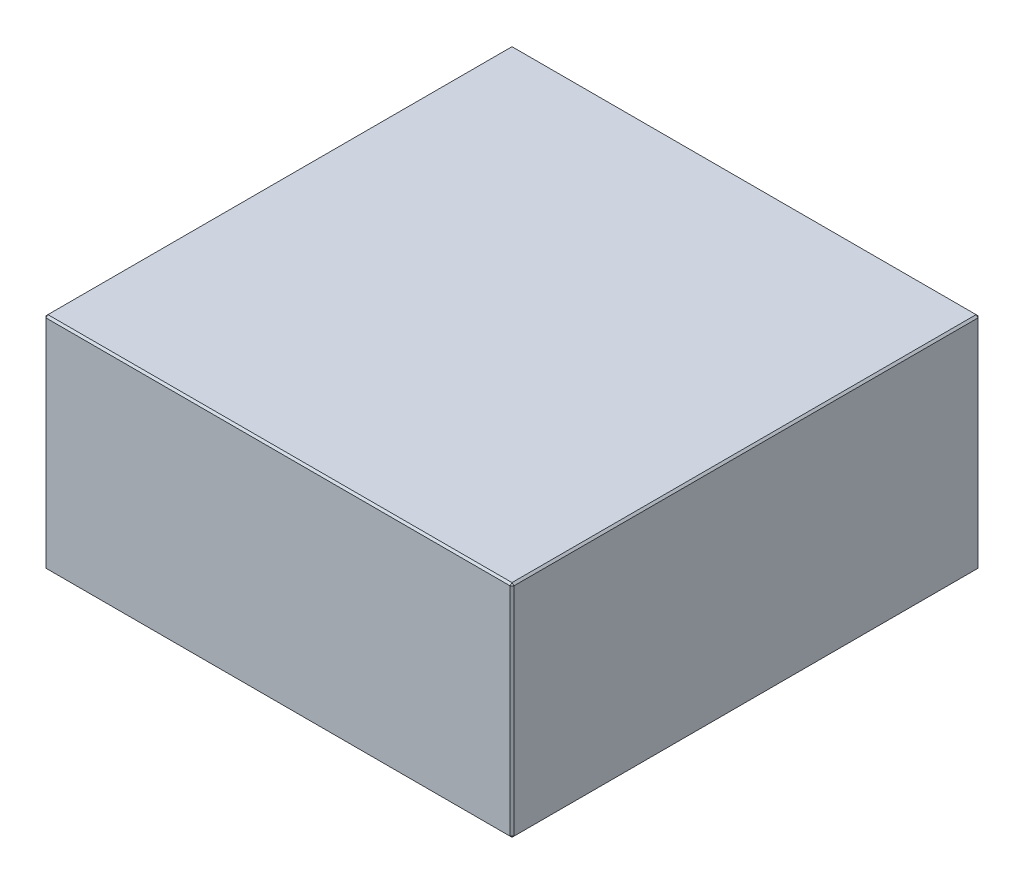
ISO-10303-21;
HEADER;
FILE_DESCRIPTION(('STEP AP214'),'2;1');
FILE_NAME('part.step','',(''),(''),'','','');
FILE_SCHEMA(('AUTOMOTIVE_DESIGN { 1 0 10303 214 1 1 1 1 }'));
ENDSEC;
DATA;
#1=APPLICATION_CONTEXT('core data for automotive mechanical design processes');
#2=APPLICATION_PROTOCOL_DEFINITION('international standard','automotive_design',2000,#1);
#3=PRODUCT_CONTEXT('',#1,'mechanical');
#4=PRODUCT('Part','Part','',(#3));
#5=PRODUCT_RELATED_PRODUCT_CATEGORY('part','',(#4));
#6=PRODUCT_DEFINITION_FORMATION('','',#4);
#7=PRODUCT_DEFINITION_CONTEXT('part definition',#1,'design');
#8=PRODUCT_DEFINITION('design','',#6,#7);
#9=PRODUCT_DEFINITION_SHAPE('','',#8);
#10=(LENGTH_UNIT() NAMED_UNIT(*) SI_UNIT(.MILLI.,.METRE.));
#11=(NAMED_UNIT(*) PLANE_ANGLE_UNIT() SI_UNIT($,.RADIAN.));
#12=(NAMED_UNIT(*) SI_UNIT($,.STERADIAN.) SOLID_ANGLE_UNIT());
#13=UNCERTAINTY_MEASURE_WITH_UNIT(LENGTH_MEASURE(1.E-05),#10,'distance_accuracy_value','');
#14=(GEOMETRIC_REPRESENTATION_CONTEXT(3) GLOBAL_UNCERTAINTY_ASSIGNED_CONTEXT((#13)) GLOBAL_UNIT_ASSIGNED_CONTEXT((#10,
#11,#12)) REPRESENTATION_CONTEXT('',''));
#15=CARTESIAN_POINT('',(0.,0.,0.));
#16=DIRECTION('',(0.,0.,1.));
#17=DIRECTION('',(1.,0.,0.));
#18=AXIS2_PLACEMENT_3D('',#15,#16,#17);
#19=CARTESIAN_POINT('',(-123.,116.,123.));
#20=DIRECTION('',(1.,0.,0.));
#21=DIRECTION('',(0.,0.,-1.));
#22=AXIS2_PLACEMENT_3D('',#19,#20,#21);
#23=PLANE('',#22);
#24=DIRECTION('',(0.,-1.,0.));
#25=VECTOR('',#24,1.);
#26=CARTESIAN_POINT('',(-123.,116.,-122.));
#27=LINE('',#26,#25);
#28=CARTESIAN_POINT('',(-123.,115.,-122.));
#29=VERTEX_POINT('',#28);
#30=CARTESIAN_POINT('',(-123.,1.,-122.));
#31=VERTEX_POINT('',#30);
#32=EDGE_CURVE('E115',#29,#31,#27,.T.);
#33=ORIENTED_EDGE('',*,*,#32,.T.);
#34=DIRECTION('',(0.,0.,1.));
#35=VECTOR('',#34,1.);
#36=CARTESIAN_POINT('',(-123.,1.,123.));
#37=LINE('',#36,#35);
#38=CARTESIAN_POINT('',(-123.,1.,122.));
#39=VERTEX_POINT('',#38);
#40=EDGE_CURVE('E111',#31,#39,#37,.T.);
#41=ORIENTED_EDGE('',*,*,#40,.T.);
#42=DIRECTION('',(0.,1.,0.));
#43=VECTOR('',#42,1.);
#44=CARTESIAN_POINT('',(-123.,116.,122.));
#45=LINE('',#44,#43);
#46=CARTESIAN_POINT('',(-123.,115.,122.));
#47=VERTEX_POINT('',#46);
#48=EDGE_CURVE('E104',#39,#47,#45,.T.);
#49=ORIENTED_EDGE('',*,*,#48,.T.);
#50=DIRECTION('',(0.,0.,-1.));
#51=VECTOR('',#50,1.);
#52=CARTESIAN_POINT('',(-123.,115.,-123.));
#53=LINE('',#52,#51);
#54=EDGE_CURVE('E108',#47,#29,#53,.T.);
#55=ORIENTED_EDGE('',*,*,#54,.T.);
#56=EDGE_LOOP('',(#33,#41,#49,#55));
#57=FACE_BOUND('',#56,.T.);
#58=ADVANCED_FACE('F16',(#57),#23,.F.);
#59=CARTESIAN_POINT('',(123.,116.,123.));
#60=DIRECTION('',(0.,0.,-1.));
#61=DIRECTION('',(-1.,0.,0.));
#62=AXIS2_PLACEMENT_3D('',#59,#60,#61);
#63=PLANE('',#62);
#64=DIRECTION('',(-1.,0.,0.));
#65=VECTOR('',#64,1.);
#66=CARTESIAN_POINT('',(-123.,115.,123.));
#67=LINE('',#66,#65);
#68=CARTESIAN_POINT('',(122.,115.,123.));
#69=VERTEX_POINT('',#68);
#70=CARTESIAN_POINT('',(-122.,115.,123.));
#71=VERTEX_POINT('',#70);
#72=EDGE_CURVE('E165',#69,#71,#67,.T.);
#73=ORIENTED_EDGE('',*,*,#72,.T.);
#74=DIRECTION('',(0.,-1.,0.));
#75=VECTOR('',#74,1.);
#76=CARTESIAN_POINT('',(-122.,116.,123.));
#77=LINE('',#76,#75);
#78=CARTESIAN_POINT('',(-122.,1.,123.));
#79=VERTEX_POINT('',#78);
#80=EDGE_CURVE('E123',#71,#79,#77,.T.);
#81=ORIENTED_EDGE('',*,*,#80,.T.);
#82=DIRECTION('',(1.,0.,0.));
#83=VECTOR('',#82,1.);
#84=CARTESIAN_POINT('',(123.,1.,123.));
#85=LINE('',#84,#83);
#86=CARTESIAN_POINT('',(122.,1.,123.));
#87=VERTEX_POINT('',#86);
#88=EDGE_CURVE('E169',#79,#87,#85,.T.);
#89=ORIENTED_EDGE('',*,*,#88,.T.);
#90=DIRECTION('',(0.,1.,0.));
#91=VECTOR('',#90,1.);
#92=CARTESIAN_POINT('',(122.,116.,123.));
#93=LINE('',#92,#91);
#94=EDGE_CURVE('E167',#87,#69,#93,.T.);
#95=ORIENTED_EDGE('',*,*,#94,.T.);
#96=EDGE_LOOP('',(#73,#81,#89,#95));
#97=FACE_BOUND('',#96,.T.);
#98=ADVANCED_FACE('F276',(#97),#63,.F.);
#99=CARTESIAN_POINT('',(123.,116.,123.));
#100=DIRECTION('',(-1.,0.,0.));
#101=DIRECTION('',(0.,0.,1.));
#102=AXIS2_PLACEMENT_3D('',#99,#100,#101);
#103=PLANE('',#102);
#104=DIRECTION('',(0.,0.,-1.));
#105=VECTOR('',#104,1.);
#106=CARTESIAN_POINT('',(123.,1.,123.));
#107=LINE('',#106,#105);
#108=CARTESIAN_POINT('',(123.,1.,122.));
#109=VERTEX_POINT('',#108);
#110=CARTESIAN_POINT('',(123.,1.,-122.));
#111=VERTEX_POINT('',#110);
#112=EDGE_CURVE('E160',#109,#111,#107,.T.);
#113=ORIENTED_EDGE('',*,*,#112,.T.);
#114=DIRECTION('',(0.,1.,0.));
#115=VECTOR('',#114,1.);
#116=CARTESIAN_POINT('',(123.,116.,-122.));
#117=LINE('',#116,#115);
#118=CARTESIAN_POINT('',(123.,115.,-122.));
#119=VERTEX_POINT('',#118);
#120=EDGE_CURVE('E162',#111,#119,#117,.T.);
#121=ORIENTED_EDGE('',*,*,#120,.T.);
#122=DIRECTION('',(0.,0.,1.));
#123=VECTOR('',#122,1.);
#124=CARTESIAN_POINT('',(123.,115.,123.));
#125=LINE('',#124,#123);
#126=CARTESIAN_POINT('',(123.,115.,122.));
#127=VERTEX_POINT('',#126);
#128=EDGE_CURVE('E156',#119,#127,#125,.T.);
#129=ORIENTED_EDGE('',*,*,#128,.T.);
#130=DIRECTION('',(0.,-1.,0.));
#131=VECTOR('',#130,1.);
#132=CARTESIAN_POINT('',(123.,116.,122.));
#133=LINE('',#132,#131);
#134=EDGE_CURVE('E158',#127,#109,#133,.T.);
#135=ORIENTED_EDGE('',*,*,#134,.T.);
#136=EDGE_LOOP('',(#113,#121,#129,#135));
#137=FACE_BOUND('',#136,.T.);
#138=ADVANCED_FACE('F255',(#137),#103,.F.);
#139=CARTESIAN_POINT('',(123.,116.,-123.));
#140=DIRECTION('',(0.,0.,1.));
#141=DIRECTION('',(1.,0.,0.));
#142=AXIS2_PLACEMENT_3D('',#139,#140,#141);
#143=PLANE('',#142);
#144=DIRECTION('',(0.,-1.,0.));
#145=VECTOR('',#144,1.);
#146=CARTESIAN_POINT('',(122.,116.,-123.));
#147=LINE('',#146,#145);
#148=CARTESIAN_POINT('',(122.,115.,-123.));
#149=VERTEX_POINT('',#148);
#150=CARTESIAN_POINT('',(122.,1.,-123.));
#151=VERTEX_POINT('',#150);
#152=EDGE_CURVE('E149',#149,#151,#147,.T.);
#153=ORIENTED_EDGE('',*,*,#152,.T.);
#154=DIRECTION('',(-1.,0.,0.));
#155=VECTOR('',#154,1.);
#156=CARTESIAN_POINT('',(123.,1.,-123.));
#157=LINE('',#156,#155);
#158=CARTESIAN_POINT('',(-122.,1.,-123.));
#159=VERTEX_POINT('',#158);
#160=EDGE_CURVE('E154',#151,#159,#157,.T.);
#161=ORIENTED_EDGE('',*,*,#160,.T.);
#162=DIRECTION('',(0.,1.,0.));
#163=VECTOR('',#162,1.);
#164=CARTESIAN_POINT('',(-122.,116.,-123.));
#165=LINE('',#164,#163);
#166=CARTESIAN_POINT('',(-122.,115.,-123.));
#167=VERTEX_POINT('',#166);
#168=EDGE_CURVE('E151',#159,#167,#165,.T.);
#169=ORIENTED_EDGE('',*,*,#168,.T.);
#170=DIRECTION('',(1.,0.,0.));
#171=VECTOR('',#170,1.);
#172=CARTESIAN_POINT('',(123.,115.,-123.));
#173=LINE('',#172,#171);
#174=EDGE_CURVE('E147',#167,#149,#173,.T.);
#175=ORIENTED_EDGE('',*,*,#174,.T.);
#176=EDGE_LOOP('',(#153,#161,#169,#175));
#177=FACE_BOUND('',#176,.T.);
#178=ADVANCED_FACE('F285',(#177),#143,.F.);
#179=CARTESIAN_POINT('',(0.,116.,0.));
#180=DIRECTION('',(0.,1.,0.));
#181=DIRECTION('',(0.,0.,1.));
#182=AXIS2_PLACEMENT_3D('',#179,#180,#181);
#183=PLANE('',#182);
#184=DIRECTION('',(0.,0.,-1.));
#185=VECTOR('',#184,1.);
#186=CARTESIAN_POINT('',(122.,116.,-123.));
#187=LINE('',#186,#185);
#188=CARTESIAN_POINT('',(122.,116.,122.));
#189=VERTEX_POINT('',#188);
#190=CARTESIAN_POINT('',(122.,116.,-122.));
#191=VERTEX_POINT('',#190);
#192=EDGE_CURVE('E25',#189,#191,#187,.T.);
#193=ORIENTED_EDGE('',*,*,#192,.T.);
#194=DIRECTION('',(-1.,0.,0.));
#195=VECTOR('',#194,1.);
#196=CARTESIAN_POINT('',(-123.,116.,-122.));
#197=LINE('',#196,#195);
#198=CARTESIAN_POINT('',(-122.,116.,-122.));
#199=VERTEX_POINT('',#198);
#200=EDGE_CURVE('E10',#191,#199,#197,.T.);
#201=ORIENTED_EDGE('',*,*,#200,.T.);
#202=DIRECTION('',(0.,0.,1.));
#203=VECTOR('',#202,1.);
#204=CARTESIAN_POINT('',(-122.,116.,123.));
#205=LINE('',#204,#203);
#206=CARTESIAN_POINT('',(-122.,116.,122.));
#207=VERTEX_POINT('',#206);
#208=EDGE_CURVE('E181',#199,#207,#205,.T.);
#209=ORIENTED_EDGE('',*,*,#208,.T.);
#210=DIRECTION('',(1.,0.,0.));
#211=VECTOR('',#210,1.);
#212=CARTESIAN_POINT('',(123.,116.,122.));
#213=LINE('',#212,#211);
#214=EDGE_CURVE('E36',#207,#189,#213,.T.);
#215=ORIENTED_EDGE('',*,*,#214,.T.);
#216=EDGE_LOOP('',(#193,#201,#209,#215));
#217=FACE_BOUND('',#216,.T.);
#218=ADVANCED_FACE('F351',(#217),#183,.T.);
#219=CARTESIAN_POINT('',(0.,0.,0.));
#220=DIRECTION('',(0.,1.,0.));
#221=DIRECTION('',(0.,0.,1.));
#222=AXIS2_PLACEMENT_3D('',#219,#220,#221);
#223=PLANE('',#222);
#224=DIRECTION('',(0.,0.,1.));
#225=VECTOR('',#224,1.);
#226=CARTESIAN_POINT('',(122.,0.,0.));
#227=LINE('',#226,#225);
#228=CARTESIAN_POINT('',(122.,0.,-122.));
#229=VERTEX_POINT('',#228);
#230=CARTESIAN_POINT('',(122.,0.,122.));
#231=VERTEX_POINT('',#230);
#232=EDGE_CURVE('E172',#229,#231,#227,.T.);
#233=ORIENTED_EDGE('',*,*,#232,.T.);
#234=DIRECTION('',(-1.,0.,0.));
#235=VECTOR('',#234,1.);
#236=CARTESIAN_POINT('',(0.,0.,122.));
#237=LINE('',#236,#235);
#238=CARTESIAN_POINT('',(-122.,0.,122.));
#239=VERTEX_POINT('',#238);
#240=EDGE_CURVE('E178',#231,#239,#237,.T.);
#241=ORIENTED_EDGE('',*,*,#240,.T.);
#242=DIRECTION('',(0.,0.,-1.));
#243=VECTOR('',#242,1.);
#244=CARTESIAN_POINT('',(-122.,0.,0.));
#245=LINE('',#244,#243);
#246=CARTESIAN_POINT('',(-122.,0.,-122.));
#247=VERTEX_POINT('',#246);
#248=EDGE_CURVE('E176',#239,#247,#245,.T.);
#249=ORIENTED_EDGE('',*,*,#248,.T.);
#250=DIRECTION('',(1.,0.,0.));
#251=VECTOR('',#250,1.);
#252=CARTESIAN_POINT('',(0.,0.,-122.));
#253=LINE('',#252,#251);
#254=EDGE_CURVE('E174',#247,#229,#253,.T.);
#255=ORIENTED_EDGE('',*,*,#254,.T.);
#256=EDGE_LOOP('',(#233,#241,#249,#255));
#257=FACE_BOUND('',#256,.T.);
#258=ADVANCED_FACE('F247',(#257),#223,.F.);
#259=CARTESIAN_POINT('',(123.,116.,122.));
#260=DIRECTION('',(-0.707106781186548,0.,-0.707106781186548));
#261=DIRECTION('',(0.,-1.,0.));
#262=AXIS2_PLACEMENT_3D('',#259,#260,#261);
#263=PLANE('',#262);
#264=DIRECTION('',(-0.707106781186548,0.,0.707106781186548));
#265=VECTOR('',#264,1.);
#266=CARTESIAN_POINT('',(122.,115.,123.));
#267=LINE('',#266,#265);
#268=EDGE_CURVE('E20',#69,#127,#267,.F.);
#269=ORIENTED_EDGE('',*,*,#268,.F.);
#270=ORIENTED_EDGE('',*,*,#94,.F.);
#271=DIRECTION('',(0.707106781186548,0.,-0.707106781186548));
#272=VECTOR('',#271,1.);
#273=CARTESIAN_POINT('',(122.,1.,123.));
#274=LINE('',#273,#272);
#275=EDGE_CURVE('E143',#109,#87,#274,.F.);
#276=ORIENTED_EDGE('',*,*,#275,.F.);
#277=ORIENTED_EDGE('',*,*,#134,.F.);
#278=EDGE_LOOP('',(#269,#270,#276,#277));
#279=FACE_BOUND('',#278,.T.);
#280=ADVANCED_FACE('F18',(#279),#263,.F.);
#281=CARTESIAN_POINT('',(122.,115.,123.));
#282=DIRECTION('',(0.577350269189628,0.57735026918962,0.577350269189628));
#283=DIRECTION('',(0.707106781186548,0.,-0.707106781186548));
#284=AXIS2_PLACEMENT_3D('',#281,#282,#283);
#285=PLANE('',#284);
#286=DIRECTION('',(0.,-0.707106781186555,0.70710678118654));
#287=VECTOR('',#286,1.);
#288=CARTESIAN_POINT('',(122.,115.,123.));
#289=LINE('',#288,#287);
#290=EDGE_CURVE('E227',#69,#189,#289,.F.);
#291=ORIENTED_EDGE('',*,*,#290,.F.);
#292=ORIENTED_EDGE('',*,*,#268,.T.);
#293=DIRECTION('',(-0.707106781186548,0.707106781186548,0.));
#294=VECTOR('',#293,1.);
#295=CARTESIAN_POINT('',(122.5,115.5,122.));
#296=LINE('',#295,#294);
#297=EDGE_CURVE('E229',#189,#127,#296,.F.);
#298=ORIENTED_EDGE('',*,*,#297,.F.);
#299=EDGE_LOOP('',(#291,#292,#298));
#300=FACE_BOUND('',#299,.T.);
#301=ADVANCED_FACE('F271',(#300),#285,.T.);
#302=CARTESIAN_POINT('',(122.,1.,123.));
#303=DIRECTION('',(0.577350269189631,-0.577350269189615,0.577350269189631));
#304=DIRECTION('',(0.707106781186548,0.,-0.707106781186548));
#305=AXIS2_PLACEMENT_3D('',#302,#303,#304);
#306=PLANE('',#305);
#307=DIRECTION('',(-0.707106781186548,-0.707106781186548,0.));
#308=VECTOR('',#307,1.);
#309=CARTESIAN_POINT('',(122.5,0.499999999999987,122.));
#310=LINE('',#309,#308);
#311=EDGE_CURVE('E221',#109,#231,#310,.T.);
#312=ORIENTED_EDGE('',*,*,#311,.F.);
#313=ORIENTED_EDGE('',*,*,#275,.T.);
#314=DIRECTION('',(0.,0.707106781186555,0.70710678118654));
#315=VECTOR('',#314,1.);
#316=CARTESIAN_POINT('',(122.,1.,123.));
#317=LINE('',#316,#315);
#318=EDGE_CURVE('E224',#231,#87,#317,.T.);
#319=ORIENTED_EDGE('',*,*,#318,.F.);
#320=EDGE_LOOP('',(#312,#313,#319));
#321=FACE_BOUND('',#320,.T.);
#322=ADVANCED_FACE('F236',(#321),#306,.T.);
#323=CARTESIAN_POINT('',(122.,116.,0.));
#324=DIRECTION('',(0.707106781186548,0.707106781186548,0.));
#325=DIRECTION('',(0.,0.,1.));
#326=AXIS2_PLACEMENT_3D('',#323,#324,#325);
#327=PLANE('',#326);
#328=ORIENTED_EDGE('',*,*,#297,.T.);
#329=ORIENTED_EDGE('',*,*,#128,.F.);
#330=DIRECTION('',(0.707106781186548,-0.707106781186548,0.));
#331=VECTOR('',#330,1.);
#332=CARTESIAN_POINT('',(123.,115.,-122.));
#333=LINE('',#332,#331);
#334=EDGE_CURVE('E216',#191,#119,#333,.T.);
#335=ORIENTED_EDGE('',*,*,#334,.F.);
#336=ORIENTED_EDGE('',*,*,#192,.F.);
#337=EDGE_LOOP('',(#328,#329,#335,#336));
#338=FACE_BOUND('',#337,.T.);
#339=ADVANCED_FACE('F266',(#338),#327,.T.);
#340=CARTESIAN_POINT('',(0.,116.,122.));
#341=DIRECTION('',(0.,0.70710678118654,0.707106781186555));
#342=DIRECTION('',(-1.,0.,0.));
#343=AXIS2_PLACEMENT_3D('',#340,#341,#342);
#344=PLANE('',#343);
#345=ORIENTED_EDGE('',*,*,#290,.T.);
#346=ORIENTED_EDGE('',*,*,#214,.F.);
#347=DIRECTION('',(0.,0.707106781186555,-0.70710678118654));
#348=VECTOR('',#347,1.);
#349=CARTESIAN_POINT('',(-122.,115.5,122.5));
#350=LINE('',#349,#348);
#351=EDGE_CURVE('E127',#71,#207,#350,.T.);
#352=ORIENTED_EDGE('',*,*,#351,.F.);
#353=ORIENTED_EDGE('',*,*,#72,.F.);
#354=EDGE_LOOP('',(#345,#346,#352,#353));
#355=FACE_BOUND('',#354,.T.);
#356=ADVANCED_FACE('F274',(#355),#344,.T.);
#357=CARTESIAN_POINT('',(-122.,116.,123.));
#358=DIRECTION('',(0.707106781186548,0.,-0.707106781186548));
#359=DIRECTION('',(0.,-1.,0.));
#360=AXIS2_PLACEMENT_3D('',#357,#358,#359);
#361=PLANE('',#360);
#362=DIRECTION('',(0.707106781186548,0.,0.707106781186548));
#363=VECTOR('',#362,1.);
#364=CARTESIAN_POINT('',(-122.,1.,123.));
#365=LINE('',#364,#363);
#366=EDGE_CURVE('E128',#79,#39,#365,.F.);
#367=ORIENTED_EDGE('',*,*,#366,.F.);
#368=ORIENTED_EDGE('',*,*,#80,.F.);
#369=DIRECTION('',(-0.707106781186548,0.,-0.707106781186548));
#370=VECTOR('',#369,1.);
#371=CARTESIAN_POINT('',(-123.,115.,122.));
#372=LINE('',#371,#370);
#373=EDGE_CURVE('E119',#47,#71,#372,.F.);
#374=ORIENTED_EDGE('',*,*,#373,.F.);
#375=ORIENTED_EDGE('',*,*,#48,.F.);
#376=EDGE_LOOP('',(#367,#368,#374,#375));
#377=FACE_BOUND('',#376,.T.);
#378=ADVANCED_FACE('F121',(#377),#361,.F.);
#379=CARTESIAN_POINT('',(123.,1.,123.));
#380=DIRECTION('',(0.,0.70710678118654,-0.707106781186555));
#381=DIRECTION('',(1.,0.,0.));
#382=AXIS2_PLACEMENT_3D('',#379,#380,#381);
#383=PLANE('',#382);
#384=ORIENTED_EDGE('',*,*,#318,.T.);
#385=ORIENTED_EDGE('',*,*,#88,.F.);
#386=DIRECTION('',(0.,-0.707106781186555,-0.70710678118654));
#387=VECTOR('',#386,1.);
#388=CARTESIAN_POINT('',(-122.,1.,123.));
#389=LINE('',#388,#387);
#390=EDGE_CURVE('E212',#239,#79,#389,.F.);
#391=ORIENTED_EDGE('',*,*,#390,.F.);
#392=ORIENTED_EDGE('',*,*,#240,.F.);
#393=EDGE_LOOP('',(#384,#385,#391,#392));
#394=FACE_BOUND('',#393,.T.);
#395=ADVANCED_FACE('F244',(#394),#383,.F.);
#396=CARTESIAN_POINT('',(123.,1.,123.));
#397=DIRECTION('',(-0.707106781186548,0.707106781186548,0.));
#398=DIRECTION('',(0.,0.,-1.));
#399=AXIS2_PLACEMENT_3D('',#396,#397,#398);
#400=PLANE('',#399);
#401=ORIENTED_EDGE('',*,*,#311,.T.);
#402=ORIENTED_EDGE('',*,*,#232,.F.);
#403=DIRECTION('',(0.707106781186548,0.707106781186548,0.));
#404=VECTOR('',#403,1.);
#405=CARTESIAN_POINT('',(122.5,0.5,-122.));
#406=LINE('',#405,#404);
#407=EDGE_CURVE('E209',#111,#229,#406,.F.);
#408=ORIENTED_EDGE('',*,*,#407,.F.);
#409=ORIENTED_EDGE('',*,*,#112,.F.);
#410=EDGE_LOOP('',(#401,#402,#408,#409));
#411=FACE_BOUND('',#410,.T.);
#412=ADVANCED_FACE('F252',(#411),#400,.F.);
#413=CARTESIAN_POINT('',(122.,116.,-123.));
#414=DIRECTION('',(-0.707106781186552,0.,0.707106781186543));
#415=DIRECTION('',(0.,-1.,0.));
#416=AXIS2_PLACEMENT_3D('',#413,#414,#415);
#417=PLANE('',#416);
#418=DIRECTION('',(0.707106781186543,0.,0.707106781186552));
#419=VECTOR('',#418,1.);
#420=CARTESIAN_POINT('',(123.,115.,-122.));
#421=LINE('',#420,#419);
#422=EDGE_CURVE('E218',#119,#149,#421,.F.);
#423=ORIENTED_EDGE('',*,*,#422,.F.);
#424=ORIENTED_EDGE('',*,*,#120,.F.);
#425=DIRECTION('',(-0.707106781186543,0.,-0.707106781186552));
#426=VECTOR('',#425,1.);
#427=CARTESIAN_POINT('',(122.,1.,-123.));
#428=LINE('',#427,#426);
#429=EDGE_CURVE('E206',#151,#111,#428,.F.);
#430=ORIENTED_EDGE('',*,*,#429,.F.);
#431=ORIENTED_EDGE('',*,*,#152,.F.);
#432=EDGE_LOOP('',(#423,#424,#430,#431));
#433=FACE_BOUND('',#432,.T.);
#434=ADVANCED_FACE('F259',(#433),#417,.F.);
#435=CARTESIAN_POINT('',(123.,115.,-122.));
#436=DIRECTION('',(0.577350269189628,0.577350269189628,-0.577350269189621));
#437=DIRECTION('',(-0.707106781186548,0.707106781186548,0.));
#438=AXIS2_PLACEMENT_3D('',#435,#436,#437);
#439=PLANE('',#438);
#440=ORIENTED_EDGE('',*,*,#334,.T.);
#441=ORIENTED_EDGE('',*,*,#422,.T.);
#442=DIRECTION('',(0.,0.707106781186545,0.70710678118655));
#443=VECTOR('',#442,1.);
#444=CARTESIAN_POINT('',(122.,115.5,-122.5));
#445=LINE('',#444,#443);
#446=EDGE_CURVE('E135',#191,#149,#445,.F.);
#447=ORIENTED_EDGE('',*,*,#446,.F.);
#448=EDGE_LOOP('',(#440,#441,#447));
#449=FACE_BOUND('',#448,.T.);
#450=ADVANCED_FACE('F326',(#449),#439,.T.);
#451=CARTESIAN_POINT('',(-123.,115.,122.));
#452=DIRECTION('',(-0.577350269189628,0.57735026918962,0.577350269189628));
#453=DIRECTION('',(0.707106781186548,0.,0.707106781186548));
#454=AXIS2_PLACEMENT_3D('',#451,#452,#453);
#455=PLANE('',#454);
#456=ORIENTED_EDGE('',*,*,#373,.T.);
#457=ORIENTED_EDGE('',*,*,#351,.T.);
#458=DIRECTION('',(-0.707106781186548,-0.707106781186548,0.));
#459=VECTOR('',#458,1.);
#460=CARTESIAN_POINT('',(-123.,115.,122.));
#461=LINE('',#460,#459);
#462=EDGE_CURVE('E131',#47,#207,#461,.F.);
#463=ORIENTED_EDGE('',*,*,#462,.F.);
#464=EDGE_LOOP('',(#456,#457,#463));
#465=FACE_BOUND('',#464,.T.);
#466=ADVANCED_FACE('F132',(#465),#455,.T.);
#467=CARTESIAN_POINT('',(-122.,1.,123.));
#468=DIRECTION('',(-0.577350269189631,-0.577350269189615,0.577350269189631));
#469=DIRECTION('',(0.707106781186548,0.,0.707106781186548));
#470=AXIS2_PLACEMENT_3D('',#467,#468,#469);
#471=PLANE('',#470);
#472=ORIENTED_EDGE('',*,*,#390,.T.);
#473=ORIENTED_EDGE('',*,*,#366,.T.);
#474=DIRECTION('',(-0.707106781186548,0.707106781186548,0.));
#475=VECTOR('',#474,1.);
#476=CARTESIAN_POINT('',(-122.5,0.499999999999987,122.));
#477=LINE('',#476,#475);
#478=EDGE_CURVE('E136',#239,#39,#477,.T.);
#479=ORIENTED_EDGE('',*,*,#478,.F.);
#480=EDGE_LOOP('',(#472,#473,#479));
#481=FACE_BOUND('',#480,.T.);
#482=ADVANCED_FACE('F319',(#481),#471,.T.);
#483=CARTESIAN_POINT('',(122.,1.,-123.));
#484=DIRECTION('',(0.577350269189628,-0.577350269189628,-0.577350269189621));
#485=DIRECTION('',(0.707106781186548,0.707106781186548,0.));
#486=AXIS2_PLACEMENT_3D('',#483,#484,#485);
#487=PLANE('',#486);
#488=ORIENTED_EDGE('',*,*,#429,.T.);
#489=ORIENTED_EDGE('',*,*,#407,.T.);
#490=DIRECTION('',(0.,-0.707106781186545,0.70710678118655));
#491=VECTOR('',#490,1.);
#492=CARTESIAN_POINT('',(122.,1.,-123.));
#493=LINE('',#492,#491);
#494=EDGE_CURVE('E199',#151,#229,#493,.T.);
#495=ORIENTED_EDGE('',*,*,#494,.F.);
#496=EDGE_LOOP('',(#488,#489,#495));
#497=FACE_BOUND('',#496,.T.);
#498=ADVANCED_FACE('F315',(#497),#487,.T.);
#499=CARTESIAN_POINT('',(0.,116.,-122.));
#500=DIRECTION('',(0.,0.70710678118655,-0.707106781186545));
#501=DIRECTION('',(1.,0.,0.));
#502=AXIS2_PLACEMENT_3D('',#499,#500,#501);
#503=PLANE('',#502);
#504=ORIENTED_EDGE('',*,*,#446,.T.);
#505=ORIENTED_EDGE('',*,*,#174,.F.);
#506=DIRECTION('',(0.,-0.707106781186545,-0.70710678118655));
#507=VECTOR('',#506,1.);
#508=CARTESIAN_POINT('',(-122.,115.,-123.));
#509=LINE('',#508,#507);
#510=EDGE_CURVE('E196',#199,#167,#509,.T.);
#511=ORIENTED_EDGE('',*,*,#510,.F.);
#512=ORIENTED_EDGE('',*,*,#200,.F.);
#513=EDGE_LOOP('',(#504,#505,#511,#512));
#514=FACE_BOUND('',#513,.T.);
#515=ADVANCED_FACE('F312',(#514),#503,.T.);
#516=CARTESIAN_POINT('',(-122.,116.,0.));
#517=DIRECTION('',(-0.707106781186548,0.707106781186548,0.));
#518=DIRECTION('',(0.,0.,-1.));
#519=AXIS2_PLACEMENT_3D('',#516,#517,#518);
#520=PLANE('',#519);
#521=ORIENTED_EDGE('',*,*,#462,.T.);
#522=ORIENTED_EDGE('',*,*,#208,.F.);
#523=DIRECTION('',(0.707106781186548,0.707106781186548,0.));
#524=VECTOR('',#523,1.);
#525=CARTESIAN_POINT('',(-122.5,115.5,-122.));
#526=LINE('',#525,#524);
#527=EDGE_CURVE('E139',#29,#199,#526,.T.);
#528=ORIENTED_EDGE('',*,*,#527,.F.);
#529=ORIENTED_EDGE('',*,*,#54,.F.);
#530=EDGE_LOOP('',(#521,#522,#528,#529));
#531=FACE_BOUND('',#530,.T.);
#532=ADVANCED_FACE('F138',(#531),#520,.T.);
#533=CARTESIAN_POINT('',(-123.,1.,123.));
#534=DIRECTION('',(0.707106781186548,0.707106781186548,0.));
#535=DIRECTION('',(0.,0.,1.));
#536=AXIS2_PLACEMENT_3D('',#533,#534,#535);
#537=PLANE('',#536);
#538=ORIENTED_EDGE('',*,*,#478,.T.);
#539=ORIENTED_EDGE('',*,*,#40,.F.);
#540=DIRECTION('',(0.707106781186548,-0.707106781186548,0.));
#541=VECTOR('',#540,1.);
#542=CARTESIAN_POINT('',(-123.,1.,-122.));
#543=LINE('',#542,#541);
#544=EDGE_CURVE('E192',#247,#31,#543,.F.);
#545=ORIENTED_EDGE('',*,*,#544,.F.);
#546=ORIENTED_EDGE('',*,*,#248,.F.);
#547=EDGE_LOOP('',(#538,#539,#545,#546));
#548=FACE_BOUND('',#547,.T.);
#549=ADVANCED_FACE('F305',(#548),#537,.F.);
#550=CARTESIAN_POINT('',(123.,1.,-123.));
#551=DIRECTION('',(0.,0.70710678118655,0.707106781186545));
#552=DIRECTION('',(-1.,0.,0.));
#553=AXIS2_PLACEMENT_3D('',#550,#551,#552);
#554=PLANE('',#553);
#555=ORIENTED_EDGE('',*,*,#494,.T.);
#556=ORIENTED_EDGE('',*,*,#254,.F.);
#557=DIRECTION('',(0.,0.707106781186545,-0.70710678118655));
#558=VECTOR('',#557,1.);
#559=CARTESIAN_POINT('',(-122.,0.500000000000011,-122.5));
#560=LINE('',#559,#558);
#561=EDGE_CURVE('E189',#159,#247,#560,.F.);
#562=ORIENTED_EDGE('',*,*,#561,.F.);
#563=ORIENTED_EDGE('',*,*,#160,.F.);
#564=EDGE_LOOP('',(#555,#556,#562,#563));
#565=FACE_BOUND('',#564,.T.);
#566=ADVANCED_FACE('F301',(#565),#554,.F.);
#567=CARTESIAN_POINT('',(-122.,115.,-123.));
#568=DIRECTION('',(-0.577350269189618,0.577350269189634,-0.577350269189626));
#569=DIRECTION('',(0.,0.707106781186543,0.707106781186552));
#570=AXIS2_PLACEMENT_3D('',#567,#568,#569);
#571=PLANE('',#570);
#572=ORIENTED_EDGE('',*,*,#527,.T.);
#573=ORIENTED_EDGE('',*,*,#510,.T.);
#574=DIRECTION('',(0.707106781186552,0.,-0.707106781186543));
#575=VECTOR('',#574,1.);
#576=CARTESIAN_POINT('',(-122.,115.,-123.));
#577=LINE('',#576,#575);
#578=EDGE_CURVE('E187',#29,#167,#577,.T.);
#579=ORIENTED_EDGE('',*,*,#578,.F.);
#580=EDGE_LOOP('',(#572,#573,#579));
#581=FACE_BOUND('',#580,.T.);
#582=ADVANCED_FACE('F297',(#581),#571,.T.);
#583=CARTESIAN_POINT('',(-123.,1.,-122.));
#584=DIRECTION('',(-0.577350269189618,-0.577350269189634,-0.577350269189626));
#585=DIRECTION('',(0.,0.707106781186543,-0.707106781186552));
#586=AXIS2_PLACEMENT_3D('',#583,#584,#585);
#587=PLANE('',#586);
#588=ORIENTED_EDGE('',*,*,#561,.T.);
#589=ORIENTED_EDGE('',*,*,#544,.T.);
#590=DIRECTION('',(-0.707106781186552,0.,0.707106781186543));
#591=VECTOR('',#590,1.);
#592=CARTESIAN_POINT('',(-123.,1.,-122.));
#593=LINE('',#592,#591);
#594=EDGE_CURVE('E185',#159,#31,#593,.T.);
#595=ORIENTED_EDGE('',*,*,#594,.F.);
#596=EDGE_LOOP('',(#588,#589,#595));
#597=FACE_BOUND('',#596,.T.);
#598=ADVANCED_FACE('F293',(#597),#587,.T.);
#599=CARTESIAN_POINT('',(-123.,116.,-122.));
#600=DIRECTION('',(0.707106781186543,0.,0.707106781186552));
#601=DIRECTION('',(0.,-1.,0.));
#602=AXIS2_PLACEMENT_3D('',#599,#600,#601);
#603=PLANE('',#602);
#604=ORIENTED_EDGE('',*,*,#578,.T.);
#605=ORIENTED_EDGE('',*,*,#168,.F.);
#606=ORIENTED_EDGE('',*,*,#594,.T.);
#607=ORIENTED_EDGE('',*,*,#32,.F.);
#608=EDGE_LOOP('',(#604,#605,#606,#607));
#609=FACE_BOUND('',#608,.T.);
#610=ADVANCED_FACE('F290',(#609),#603,.F.);
#611=CLOSED_SHELL('',(#58,#98,#138,#178,#218,#258,#280,#301,#322,#339,#356,#378,#395,#412,#434,
#450,#466,#482,#498,#515,#532,#549,#566,#582,#598,#610));
#612=MANIFOLD_SOLID_BREP('B1',#611);
#613=ADVANCED_BREP_SHAPE_REPRESENTATION('',(#18,#612),#14);
#614=SHAPE_DEFINITION_REPRESENTATION(#9,#613);
ENDSEC;
END-ISO-10303-21;
